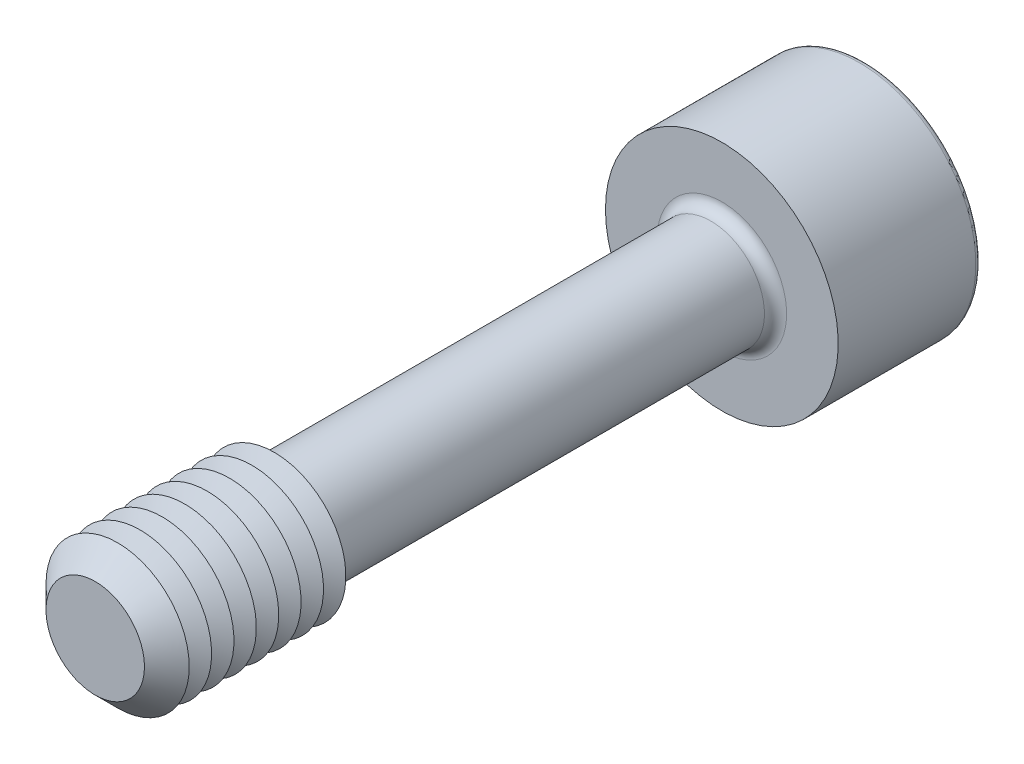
from build123d import *

# Parameters (mm, degrees)
SKETCH1_R       = 3
EXTRUDE1_DEPTH  = 17.5
CHAMFER1_SIZE   = 1.25
SKETCH3_R       = 6.5
EXTRUDE2_DEPTH  = 8
EXTRUDE3_DEPTH  = 6
FILLET1_R       = 0.62
FILLET2_R       = 0.31
LPATTERN1_COUNT = 7
LPATTERN1_PITCH = 1.25


with BuildPart() as part:
    # Sketch1 → Extrude1 (new, symmetric)
    with BuildSketch(Plane.XY):
        Circle(SKETCH1_R)
    extrude(amount=EXTRUDE1_DEPTH, both=True)

    # Sketch2 → Revolve1 (revolve)
    with BuildSketch(Plane(origin=(0, 0, 0), x_dir=(0, 0, -1), z_dir=(1, 0, 0))):
        Polygon((-17.5, 0), (-17.5, 4), (-7.5, 4), (-6.922649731, 3), (-6.922649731, 0), align=None)
    revolve(axis=Axis((0, 0, 6.922649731), (0, 0, 1)))

    # Chamfer1
    chamfer1_edges = [part.edges().sort_by_distance(p)[0] for p in [
        (0, -4, 17.5),
    ]]
    chamfer(chamfer1_edges, length=CHAMFER1_SIZE)

    # Sketch3 → Extrude2 (add)
    with BuildSketch(Plane(origin=(0, 0, -17.5), x_dir=(-1, 0, 0), z_dir=(0, 0, -1))):
        Circle(SKETCH3_R)
    extrude(amount=EXTRUDE2_DEPTH)

    # Sketch4 → Extrude3 (cut)
    with BuildSketch(Plane(origin=(-13.7, 0, -25.5), x_dir=(1, 0, 0), z_dir=(0, 0, 1))):
        Polygon((11.967949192, -3), (15.432050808, -3), (17.164101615, 0), (15.432050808, 3), (11.967949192, 3), (10.235898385, 0), align=None)
    extrude(amount=EXTRUDE3_DEPTH, mode=Mode.SUBTRACT)

    # Fillet1
    fillet1_edges = [part.edges().sort_by_distance(p)[0] for p in [
        (-3, 0, -17.5),
    ]]
    fillet(fillet1_edges, radius=FILLET1_R)

    # Fillet2
    fillet2_edges = [part.edges().sort_by_distance(p)[0] for p in [
        (6.5, 0, -25.5),
    ]]
    fillet(fillet2_edges, radius=FILLET2_R)

    # Sketch5 → Cut-Revolve1 (revolve, cut)
    with BuildSketch(Plane(origin=(0, 0, 0), x_dir=(0, 0, -1), z_dir=(1, 0, 0)), mode=Mode.PRIVATE) as cut_revolve1_sk:
        Polygon((19.5, 0), (19.5, -3), (17.767949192, 0), align=None)
    revolve(cut_revolve1_sk.sketch.rotate(Axis((0, 0, -17.767949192), (0, 0, -1)), 90), axis=Axis((0, 0, -17.767949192), (0, 0, -1)), mode=Mode.SUBTRACT)

    # Sketch7 → Cut-Revolve2 (revolve, cut)
    with BuildSketch(Plane(origin=(0, 0, 0), x_dir=(0, 0, -1), z_dir=(1, 0, 0)), mode=Mode.PRIVATE) as cut_revolve2_sk:
        Polygon((-7.5, 4), (-8.125, 2.917468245), (-8.75, 4), align=None)
    cut_revolve2 = revolve(cut_revolve2_sk.sketch.rotate(Axis((0, 0, -1.332048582), (0, 0, 1)), 90), axis=Axis((0, 0, -1.332048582), (0, 0, 1)), mode=Mode.SUBTRACT)

    # LPattern1: Cut-Revolve2 ×7
    with Locations(*[(0, 0, i * LPATTERN1_PITCH) for i in range(1, LPATTERN1_COUNT)]):
        add(cut_revolve2, mode=Mode.SUBTRACT)


solid = part.part
